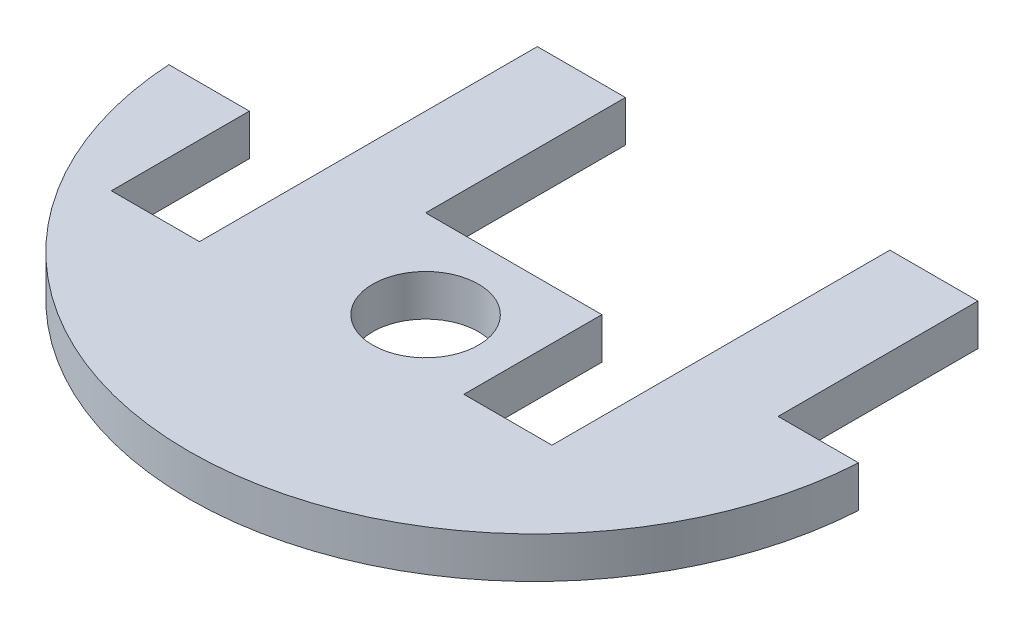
ISO-10303-21;
HEADER;
FILE_DESCRIPTION(('STEP AP214'),'2;1');
FILE_NAME('part.step','',(''),(''),'','','');
FILE_SCHEMA(('AUTOMOTIVE_DESIGN { 1 0 10303 214 1 1 1 1 }'));
ENDSEC;
DATA;
#1=APPLICATION_CONTEXT('core data for automotive mechanical design processes');
#2=APPLICATION_PROTOCOL_DEFINITION('international standard','automotive_design',2000,#1);
#3=PRODUCT_CONTEXT('',#1,'mechanical');
#4=PRODUCT('Part','Part','',(#3));
#5=PRODUCT_RELATED_PRODUCT_CATEGORY('part','',(#4));
#6=PRODUCT_DEFINITION_FORMATION('','',#4);
#7=PRODUCT_DEFINITION_CONTEXT('part definition',#1,'design');
#8=PRODUCT_DEFINITION('design','',#6,#7);
#9=PRODUCT_DEFINITION_SHAPE('','',#8);
#10=(LENGTH_UNIT() NAMED_UNIT(*) SI_UNIT(.MILLI.,.METRE.));
#11=(NAMED_UNIT(*) PLANE_ANGLE_UNIT() SI_UNIT($,.RADIAN.));
#12=(NAMED_UNIT(*) SI_UNIT($,.STERADIAN.) SOLID_ANGLE_UNIT());
#13=UNCERTAINTY_MEASURE_WITH_UNIT(LENGTH_MEASURE(1.E-05),#10,'distance_accuracy_value','');
#14=(GEOMETRIC_REPRESENTATION_CONTEXT(3) GLOBAL_UNCERTAINTY_ASSIGNED_CONTEXT((#13)) GLOBAL_UNIT_ASSIGNED_CONTEXT((#10,
#11,#12)) REPRESENTATION_CONTEXT('',''));
#15=CARTESIAN_POINT('',(0.,0.,0.));
#16=DIRECTION('',(0.,0.,1.));
#17=DIRECTION('',(1.,0.,0.));
#18=AXIS2_PLACEMENT_3D('',#15,#16,#17);
#19=CARTESIAN_POINT('',(-27.1869130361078,0.,1.4859));
#20=DIRECTION('',(0.,0.,1.));
#21=DIRECTION('',(1.,0.,0.));
#22=AXIS2_PLACEMENT_3D('',#19,#20,#21);
#23=PLANE('',#22);
#24=DIRECTION('',(1.,0.,0.));
#25=VECTOR('',#24,1.);
#26=CARTESIAN_POINT('',(-27.1869130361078,2.9718,1.4859));
#27=LINE('',#26,#25);
#28=CARTESIAN_POINT('',(-6.35,2.9718,1.4859));
#29=VERTEX_POINT('',#28);
#30=CARTESIAN_POINT('',(6.35,2.9718,1.4859));
#31=VERTEX_POINT('',#30);
#32=EDGE_CURVE('E156',#29,#31,#27,.T.);
#33=ORIENTED_EDGE('',*,*,#32,.T.);
#34=DIRECTION('',(0.,1.,0.));
#35=VECTOR('',#34,1.);
#36=CARTESIAN_POINT('',(6.35,0.,1.4859));
#37=LINE('',#36,#35);
#38=CARTESIAN_POINT('',(6.35,0.,1.4859));
#39=VERTEX_POINT('',#38);
#40=EDGE_CURVE('E143',#39,#31,#37,.T.);
#41=ORIENTED_EDGE('',*,*,#40,.F.);
#42=DIRECTION('',(1.,0.,0.));
#43=VECTOR('',#42,1.);
#44=CARTESIAN_POINT('',(0.,0.,1.4859));
#45=LINE('',#44,#43);
#46=CARTESIAN_POINT('',(-6.35,0.,1.4859));
#47=VERTEX_POINT('',#46);
#48=EDGE_CURVE('E44',#47,#39,#45,.T.);
#49=ORIENTED_EDGE('',*,*,#48,.F.);
#50=DIRECTION('',(0.,1.,0.));
#51=VECTOR('',#50,1.);
#52=CARTESIAN_POINT('',(-6.35,0.,1.4859));
#53=LINE('',#52,#51);
#54=EDGE_CURVE('E196',#47,#29,#53,.T.);
#55=ORIENTED_EDGE('',*,*,#54,.T.);
#56=EDGE_LOOP('',(#33,#41,#49,#55));
#57=FACE_BOUND('',#56,.T.);
#58=ADVANCED_FACE('F36',(#57),#23,.F.);
#59=CARTESIAN_POINT('',(-24.8476108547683,2.9718,1.4859));
#60=VERTEX_POINT('',#59);
#61=CARTESIAN_POINT('',(-19.05,2.9718,1.4859));
#62=VERTEX_POINT('',#61);
#63=EDGE_CURVE('E176',#60,#62,#27,.T.);
#64=ORIENTED_EDGE('',*,*,#63,.T.);
#65=DIRECTION('',(0.,1.,0.));
#66=VECTOR('',#65,1.);
#67=CARTESIAN_POINT('',(-19.05,0.,1.4859));
#68=LINE('',#67,#66);
#69=CARTESIAN_POINT('',(-19.05,0.,1.4859));
#70=VERTEX_POINT('',#69);
#71=EDGE_CURVE('E223',#70,#62,#68,.T.);
#72=ORIENTED_EDGE('',*,*,#71,.F.);
#73=CARTESIAN_POINT('',(-24.8476108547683,0.,1.4859));
#74=VERTEX_POINT('',#73);
#75=EDGE_CURVE('E11',#74,#70,#45,.T.);
#76=ORIENTED_EDGE('',*,*,#75,.F.);
#77=DIRECTION('',(0.,-1.,0.));
#78=VECTOR('',#77,1.);
#79=CARTESIAN_POINT('',(-24.8476108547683,2.9718,1.4859));
#80=LINE('',#79,#78);
#81=EDGE_CURVE('E169',#60,#74,#80,.T.);
#82=ORIENTED_EDGE('',*,*,#81,.F.);
#83=EDGE_LOOP('',(#64,#72,#76,#82));
#84=FACE_BOUND('',#83,.T.);
#85=ADVANCED_FACE('F281',(#84),#23,.F.);
#86=CARTESIAN_POINT('',(0.,2.9718,0.));
#87=DIRECTION('',(0.,-1.,0.));
#88=DIRECTION('',(0.,0.,-1.));
#89=AXIS2_PLACEMENT_3D('',#86,#87,#88);
#90=CYLINDRICAL_SURFACE('',#89,24.892);
#91=CARTESIAN_POINT('',(0.,2.9718,0.));
#92=DIRECTION('',(0.,1.,0.));
#93=DIRECTION('',(0.,0.,1.));
#94=AXIS2_PLACEMENT_3D('',#91,#92,#93);
#95=CIRCLE('',#94,24.892);
#96=CARTESIAN_POINT('',(24.8476108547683,2.9718,1.4859));
#97=VERTEX_POINT('',#96);
#98=EDGE_CURVE('E159',#60,#97,#95,.T.);
#99=ORIENTED_EDGE('',*,*,#98,.F.);
#100=ORIENTED_EDGE('',*,*,#81,.T.);
#101=CARTESIAN_POINT('',(0.,0.,0.));
#102=DIRECTION('',(0.,1.,0.));
#103=DIRECTION('',(0.,0.,1.));
#104=AXIS2_PLACEMENT_3D('',#101,#102,#103);
#105=CIRCLE('',#104,24.892);
#106=CARTESIAN_POINT('',(24.8476108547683,0.,1.4859));
#107=VERTEX_POINT('',#106);
#108=EDGE_CURVE('E163',#74,#107,#105,.T.);
#109=ORIENTED_EDGE('',*,*,#108,.T.);
#110=DIRECTION('',(0.,-1.,0.));
#111=VECTOR('',#110,1.);
#112=CARTESIAN_POINT('',(24.8476108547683,2.9718,1.4859));
#113=LINE('',#112,#111);
#114=EDGE_CURVE('E173',#107,#97,#113,.F.);
#115=ORIENTED_EDGE('',*,*,#114,.T.);
#116=EDGE_LOOP('',(#99,#100,#109,#115));
#117=FACE_BOUND('',#116,.T.);
#118=ADVANCED_FACE('F38',(#117),#90,.T.);
#119=CARTESIAN_POINT('',(0.,2.9718,0.));
#120=DIRECTION('',(0.,1.,0.));
#121=DIRECTION('',(0.,0.,1.));
#122=AXIS2_PLACEMENT_3D('',#119,#120,#121);
#123=PLANE('',#122);
#124=CARTESIAN_POINT('',(0.,2.9718,7.8359));
#125=DIRECTION('',(0.,1.,0.));
#126=DIRECTION('',(0.,0.,1.));
#127=AXIS2_PLACEMENT_3D('',#124,#125,#126);
#128=CIRCLE('',#127,3.81);
#129=CARTESIAN_POINT('',(0.,2.9718,11.6459));
#130=VERTEX_POINT('',#129);
#131=EDGE_CURVE('E251',#130,#130,#128,.T.);
#132=ORIENTED_EDGE('',*,*,#131,.F.);
#133=EDGE_LOOP('',(#132));
#134=FACE_BOUND('',#133,.T.);
#135=DIRECTION('',(0.,0.,1.));
#136=VECTOR('',#135,1.);
#137=CARTESIAN_POINT('',(12.7,2.9718,1.4859));
#138=LINE('',#137,#136);
#139=CARTESIAN_POINT('',(12.7,2.9718,-12.9159));
#140=VERTEX_POINT('',#139);
#141=CARTESIAN_POINT('',(12.7,2.9718,11.43));
#142=VERTEX_POINT('',#141);
#143=EDGE_CURVE('E194',#140,#142,#138,.T.);
#144=ORIENTED_EDGE('',*,*,#143,.T.);
#145=DIRECTION('',(1.,0.,0.));
#146=VECTOR('',#145,1.);
#147=CARTESIAN_POINT('',(12.7,2.9718,11.43));
#148=LINE('',#147,#146);
#149=CARTESIAN_POINT('',(6.35,2.9718,11.43));
#150=VERTEX_POINT('',#149);
#151=EDGE_CURVE('E149',#150,#142,#148,.T.);
#152=ORIENTED_EDGE('',*,*,#151,.F.);
#153=DIRECTION('',(0.,0.,1.));
#154=VECTOR('',#153,1.);
#155=CARTESIAN_POINT('',(6.35,2.9718,1.4859));
#156=LINE('',#155,#154);
#157=EDGE_CURVE('E231',#31,#150,#156,.T.);
#158=ORIENTED_EDGE('',*,*,#157,.F.);
#159=ORIENTED_EDGE('',*,*,#32,.F.);
#160=DIRECTION('',(0.,0.,-1.));
#161=VECTOR('',#160,1.);
#162=CARTESIAN_POINT('',(-6.35,2.9718,1.4859));
#163=LINE('',#162,#161);
#164=CARTESIAN_POINT('',(-6.35,2.9718,-12.9159));
#165=VERTEX_POINT('',#164);
#166=EDGE_CURVE('E214',#29,#165,#163,.T.);
#167=ORIENTED_EDGE('',*,*,#166,.T.);
#168=DIRECTION('',(-1.,0.,0.));
#169=VECTOR('',#168,1.);
#170=CARTESIAN_POINT('',(-6.35,2.9718,-12.9159));
#171=LINE('',#170,#169);
#172=CARTESIAN_POINT('',(-12.7,2.9718,-12.9159));
#173=VERTEX_POINT('',#172);
#174=EDGE_CURVE('E211',#165,#173,#171,.T.);
#175=ORIENTED_EDGE('',*,*,#174,.T.);
#176=DIRECTION('',(0.,0.,1.));
#177=VECTOR('',#176,1.);
#178=CARTESIAN_POINT('',(-12.7,2.9718,1.4859));
#179=LINE('',#178,#177);
#180=CARTESIAN_POINT('',(-12.7,2.9718,11.43));
#181=VERTEX_POINT('',#180);
#182=EDGE_CURVE('E209',#173,#181,#179,.T.);
#183=ORIENTED_EDGE('',*,*,#182,.T.);
#184=DIRECTION('',(1.,0.,0.));
#185=VECTOR('',#184,1.);
#186=CARTESIAN_POINT('',(-12.7,2.9718,11.43));
#187=LINE('',#186,#185);
#188=CARTESIAN_POINT('',(-19.05,2.9718,11.43));
#189=VERTEX_POINT('',#188);
#190=EDGE_CURVE('E232',#189,#181,#187,.T.);
#191=ORIENTED_EDGE('',*,*,#190,.F.);
#192=DIRECTION('',(0.,0.,1.));
#193=VECTOR('',#192,1.);
#194=CARTESIAN_POINT('',(-19.05,2.9718,1.4859));
#195=LINE('',#194,#193);
#196=EDGE_CURVE('E236',#62,#189,#195,.T.);
#197=ORIENTED_EDGE('',*,*,#196,.F.);
#198=ORIENTED_EDGE('',*,*,#63,.F.);
#199=ORIENTED_EDGE('',*,*,#98,.T.);
#200=CARTESIAN_POINT('',(19.05,2.9718,1.4859));
#201=VERTEX_POINT('',#200);
#202=EDGE_CURVE('E179',#201,#97,#27,.T.);
#203=ORIENTED_EDGE('',*,*,#202,.F.);
#204=DIRECTION('',(0.,0.,-1.));
#205=VECTOR('',#204,1.);
#206=CARTESIAN_POINT('',(19.05,2.9718,1.4859));
#207=LINE('',#206,#205);
#208=CARTESIAN_POINT('',(19.05,2.9718,-12.9159));
#209=VERTEX_POINT('',#208);
#210=EDGE_CURVE('E191',#201,#209,#207,.T.);
#211=ORIENTED_EDGE('',*,*,#210,.T.);
#212=DIRECTION('',(-1.,0.,0.));
#213=VECTOR('',#212,1.);
#214=CARTESIAN_POINT('',(12.7,2.9718,-12.9159));
#215=LINE('',#214,#213);
#216=EDGE_CURVE('E187',#209,#140,#215,.T.);
#217=ORIENTED_EDGE('',*,*,#216,.T.);
#218=EDGE_LOOP('',(#144,#152,#158,#159,#167,#175,#183,#191,#197,#198,#199,#203,#211,#217));
#219=FACE_BOUND('',#218,.T.);
#220=ADVANCED_FACE('F264',(#134,#219),#123,.T.);
#221=CARTESIAN_POINT('',(0.,0.,0.));
#222=DIRECTION('',(0.,1.,0.));
#223=DIRECTION('',(0.,0.,1.));
#224=AXIS2_PLACEMENT_3D('',#221,#222,#223);
#225=PLANE('',#224);
#226=CARTESIAN_POINT('',(0.,0.,7.8359));
#227=DIRECTION('',(0.,1.,0.));
#228=DIRECTION('',(0.,0.,1.));
#229=AXIS2_PLACEMENT_3D('',#226,#227,#228);
#230=CIRCLE('',#229,3.81);
#231=CARTESIAN_POINT('',(0.,0.,11.6459));
#232=VERTEX_POINT('',#231);
#233=EDGE_CURVE('E239',#232,#232,#230,.T.);
#234=ORIENTED_EDGE('',*,*,#233,.T.);
#235=EDGE_LOOP('',(#234));
#236=FACE_BOUND('',#235,.T.);
#237=DIRECTION('',(1.,0.,0.));
#238=VECTOR('',#237,1.);
#239=CARTESIAN_POINT('',(12.7,0.,11.43));
#240=LINE('',#239,#238);
#241=CARTESIAN_POINT('',(6.35,0.,11.43));
#242=VERTEX_POINT('',#241);
#243=CARTESIAN_POINT('',(12.7,0.,11.43));
#244=VERTEX_POINT('',#243);
#245=EDGE_CURVE('E148',#242,#244,#240,.T.);
#246=ORIENTED_EDGE('',*,*,#245,.T.);
#247=DIRECTION('',(0.,0.,1.));
#248=VECTOR('',#247,1.);
#249=CARTESIAN_POINT('',(12.7,0.,1.4859));
#250=LINE('',#249,#248);
#251=CARTESIAN_POINT('',(12.7,0.,-12.9159));
#252=VERTEX_POINT('',#251);
#253=EDGE_CURVE('E190',#252,#244,#250,.T.);
#254=ORIENTED_EDGE('',*,*,#253,.F.);
#255=DIRECTION('',(-1.,0.,0.));
#256=VECTOR('',#255,1.);
#257=CARTESIAN_POINT('',(12.7,0.,-12.9159));
#258=LINE('',#257,#256);
#259=CARTESIAN_POINT('',(19.05,0.,-12.9159));
#260=VERTEX_POINT('',#259);
#261=EDGE_CURVE('E183',#260,#252,#258,.T.);
#262=ORIENTED_EDGE('',*,*,#261,.F.);
#263=DIRECTION('',(0.,0.,-1.));
#264=VECTOR('',#263,1.);
#265=CARTESIAN_POINT('',(19.05,0.,1.4859));
#266=LINE('',#265,#264);
#267=CARTESIAN_POINT('',(19.05,0.,1.4859));
#268=VERTEX_POINT('',#267);
#269=EDGE_CURVE('E199',#268,#260,#266,.T.);
#270=ORIENTED_EDGE('',*,*,#269,.F.);
#271=EDGE_CURVE('E45',#268,#107,#45,.T.);
#272=ORIENTED_EDGE('',*,*,#271,.T.);
#273=ORIENTED_EDGE('',*,*,#108,.F.);
#274=ORIENTED_EDGE('',*,*,#75,.T.);
#275=DIRECTION('',(0.,0.,1.));
#276=VECTOR('',#275,1.);
#277=CARTESIAN_POINT('',(-19.05,0.,1.4859));
#278=LINE('',#277,#276);
#279=CARTESIAN_POINT('',(-19.05,0.,11.43));
#280=VERTEX_POINT('',#279);
#281=EDGE_CURVE('E235',#70,#280,#278,.T.);
#282=ORIENTED_EDGE('',*,*,#281,.T.);
#283=DIRECTION('',(1.,0.,0.));
#284=VECTOR('',#283,1.);
#285=CARTESIAN_POINT('',(-12.7,0.,11.43));
#286=LINE('',#285,#284);
#287=CARTESIAN_POINT('',(-12.7,0.,11.43));
#288=VERTEX_POINT('',#287);
#289=EDGE_CURVE('E226',#280,#288,#286,.T.);
#290=ORIENTED_EDGE('',*,*,#289,.T.);
#291=DIRECTION('',(0.,0.,1.));
#292=VECTOR('',#291,1.);
#293=CARTESIAN_POINT('',(-12.7,0.,1.4859));
#294=LINE('',#293,#292);
#295=CARTESIAN_POINT('',(-12.7,0.,-12.9159));
#296=VERTEX_POINT('',#295);
#297=EDGE_CURVE('E206',#296,#288,#294,.T.);
#298=ORIENTED_EDGE('',*,*,#297,.F.);
#299=DIRECTION('',(-1.,0.,0.));
#300=VECTOR('',#299,1.);
#301=CARTESIAN_POINT('',(-6.35,0.,-12.9159));
#302=LINE('',#301,#300);
#303=CARTESIAN_POINT('',(-6.35,0.,-12.9159));
#304=VERTEX_POINT('',#303);
#305=EDGE_CURVE('E219',#304,#296,#302,.T.);
#306=ORIENTED_EDGE('',*,*,#305,.F.);
#307=DIRECTION('',(0.,0.,-1.));
#308=VECTOR('',#307,1.);
#309=CARTESIAN_POINT('',(-6.35,0.,1.4859));
#310=LINE('',#309,#308);
#311=EDGE_CURVE('E52',#47,#304,#310,.T.);
#312=ORIENTED_EDGE('',*,*,#311,.F.);
#313=ORIENTED_EDGE('',*,*,#48,.T.);
#314=DIRECTION('',(0.,0.,1.));
#315=VECTOR('',#314,1.);
#316=CARTESIAN_POINT('',(6.35,0.,1.4859));
#317=LINE('',#316,#315);
#318=EDGE_CURVE('E139',#39,#242,#317,.T.);
#319=ORIENTED_EDGE('',*,*,#318,.T.);
#320=EDGE_LOOP('',(#246,#254,#262,#270,#272,#273,#274,#282,#290,#298,#306,#312,#313,#319));
#321=FACE_BOUND('',#320,.T.);
#322=ADVANCED_FACE('F158',(#236,#321),#225,.F.);
#323=ORIENTED_EDGE('',*,*,#271,.F.);
#324=DIRECTION('',(0.,1.,0.));
#325=VECTOR('',#324,1.);
#326=CARTESIAN_POINT('',(19.05,0.,1.4859));
#327=LINE('',#326,#325);
#328=EDGE_CURVE('E180',#268,#201,#327,.T.);
#329=ORIENTED_EDGE('',*,*,#328,.T.);
#330=ORIENTED_EDGE('',*,*,#202,.T.);
#331=ORIENTED_EDGE('',*,*,#114,.F.);
#332=EDGE_LOOP('',(#323,#329,#330,#331));
#333=FACE_BOUND('',#332,.T.);
#334=ADVANCED_FACE('F276',(#333),#23,.F.);
#335=CARTESIAN_POINT('',(12.7,0.,1.4859));
#336=DIRECTION('',(-1.,0.,0.));
#337=DIRECTION('',(0.,0.,1.));
#338=AXIS2_PLACEMENT_3D('',#335,#336,#337);
#339=PLANE('',#338);
#340=ORIENTED_EDGE('',*,*,#143,.F.);
#341=DIRECTION('',(0.,1.,0.));
#342=VECTOR('',#341,1.);
#343=CARTESIAN_POINT('',(12.7,0.,-12.9159));
#344=LINE('',#343,#342);
#345=EDGE_CURVE('E185',#252,#140,#344,.T.);
#346=ORIENTED_EDGE('',*,*,#345,.F.);
#347=ORIENTED_EDGE('',*,*,#253,.T.);
#348=DIRECTION('',(0.,1.,0.));
#349=VECTOR('',#348,1.);
#350=CARTESIAN_POINT('',(12.7,0.,11.43));
#351=LINE('',#350,#349);
#352=EDGE_CURVE('E217',#244,#142,#351,.T.);
#353=ORIENTED_EDGE('',*,*,#352,.T.);
#354=EDGE_LOOP('',(#340,#346,#347,#353));
#355=FACE_BOUND('',#354,.T.);
#356=ADVANCED_FACE('F272',(#355),#339,.T.);
#357=CARTESIAN_POINT('',(12.7,0.,-12.9159));
#358=DIRECTION('',(0.,0.,-1.));
#359=DIRECTION('',(-1.,0.,0.));
#360=AXIS2_PLACEMENT_3D('',#357,#358,#359);
#361=PLANE('',#360);
#362=ORIENTED_EDGE('',*,*,#216,.F.);
#363=DIRECTION('',(0.,1.,0.));
#364=VECTOR('',#363,1.);
#365=CARTESIAN_POINT('',(19.05,0.,-12.9159));
#366=LINE('',#365,#364);
#367=EDGE_CURVE('E182',#260,#209,#366,.T.);
#368=ORIENTED_EDGE('',*,*,#367,.F.);
#369=ORIENTED_EDGE('',*,*,#261,.T.);
#370=ORIENTED_EDGE('',*,*,#345,.T.);
#371=EDGE_LOOP('',(#362,#368,#369,#370));
#372=FACE_BOUND('',#371,.T.);
#373=ADVANCED_FACE('F307',(#372),#361,.T.);
#374=CARTESIAN_POINT('',(19.05,0.,1.4859));
#375=DIRECTION('',(1.,0.,0.));
#376=DIRECTION('',(0.,0.,-1.));
#377=AXIS2_PLACEMENT_3D('',#374,#375,#376);
#378=PLANE('',#377);
#379=ORIENTED_EDGE('',*,*,#210,.F.);
#380=ORIENTED_EDGE('',*,*,#328,.F.);
#381=ORIENTED_EDGE('',*,*,#269,.T.);
#382=ORIENTED_EDGE('',*,*,#367,.T.);
#383=EDGE_LOOP('',(#379,#380,#381,#382));
#384=FACE_BOUND('',#383,.T.);
#385=ADVANCED_FACE('F300',(#384),#378,.T.);
#386=CARTESIAN_POINT('',(-6.35,0.,1.4859));
#387=DIRECTION('',(1.,0.,0.));
#388=DIRECTION('',(0.,0.,-1.));
#389=AXIS2_PLACEMENT_3D('',#386,#387,#388);
#390=PLANE('',#389);
#391=ORIENTED_EDGE('',*,*,#166,.F.);
#392=ORIENTED_EDGE('',*,*,#54,.F.);
#393=ORIENTED_EDGE('',*,*,#311,.T.);
#394=DIRECTION('',(0.,1.,0.));
#395=VECTOR('',#394,1.);
#396=CARTESIAN_POINT('',(-6.35,0.,-12.9159));
#397=LINE('',#396,#395);
#398=EDGE_CURVE('E203',#304,#165,#397,.T.);
#399=ORIENTED_EDGE('',*,*,#398,.T.);
#400=EDGE_LOOP('',(#391,#392,#393,#399));
#401=FACE_BOUND('',#400,.T.);
#402=ADVANCED_FACE('F297',(#401),#390,.T.);
#403=CARTESIAN_POINT('',(-12.7,0.,1.4859));
#404=DIRECTION('',(-1.,0.,0.));
#405=DIRECTION('',(0.,0.,1.));
#406=AXIS2_PLACEMENT_3D('',#403,#404,#405);
#407=PLANE('',#406);
#408=ORIENTED_EDGE('',*,*,#182,.F.);
#409=DIRECTION('',(0.,1.,0.));
#410=VECTOR('',#409,1.);
#411=CARTESIAN_POINT('',(-12.7,0.,-12.9159));
#412=LINE('',#411,#410);
#413=EDGE_CURVE('E205',#296,#173,#412,.T.);
#414=ORIENTED_EDGE('',*,*,#413,.F.);
#415=ORIENTED_EDGE('',*,*,#297,.T.);
#416=DIRECTION('',(0.,1.,0.));
#417=VECTOR('',#416,1.);
#418=CARTESIAN_POINT('',(-12.7,0.,11.43));
#419=LINE('',#418,#417);
#420=EDGE_CURVE('E228',#288,#181,#419,.T.);
#421=ORIENTED_EDGE('',*,*,#420,.T.);
#422=EDGE_LOOP('',(#408,#414,#415,#421));
#423=FACE_BOUND('',#422,.T.);
#424=ADVANCED_FACE('F299',(#423),#407,.T.);
#425=CARTESIAN_POINT('',(-6.35,0.,-12.9159));
#426=DIRECTION('',(0.,0.,-1.));
#427=DIRECTION('',(-1.,0.,0.));
#428=AXIS2_PLACEMENT_3D('',#425,#426,#427);
#429=PLANE('',#428);
#430=ORIENTED_EDGE('',*,*,#174,.F.);
#431=ORIENTED_EDGE('',*,*,#398,.F.);
#432=ORIENTED_EDGE('',*,*,#305,.T.);
#433=ORIENTED_EDGE('',*,*,#413,.T.);
#434=EDGE_LOOP('',(#430,#431,#432,#433));
#435=FACE_BOUND('',#434,.T.);
#436=ADVANCED_FACE('F295',(#435),#429,.T.);
#437=CARTESIAN_POINT('',(-12.7,0.,11.43));
#438=DIRECTION('',(0.,0.,1.));
#439=DIRECTION('',(1.,0.,0.));
#440=AXIS2_PLACEMENT_3D('',#437,#438,#439);
#441=PLANE('',#440);
#442=ORIENTED_EDGE('',*,*,#190,.T.);
#443=ORIENTED_EDGE('',*,*,#420,.F.);
#444=ORIENTED_EDGE('',*,*,#289,.F.);
#445=DIRECTION('',(0.,1.,0.));
#446=VECTOR('',#445,1.);
#447=CARTESIAN_POINT('',(-19.05,0.,11.43));
#448=LINE('',#447,#446);
#449=EDGE_CURVE('E225',#280,#189,#448,.T.);
#450=ORIENTED_EDGE('',*,*,#449,.T.);
#451=EDGE_LOOP('',(#442,#443,#444,#450));
#452=FACE_BOUND('',#451,.T.);
#453=ADVANCED_FACE('F289',(#452),#441,.F.);
#454=CARTESIAN_POINT('',(-19.05,0.,1.4859));
#455=DIRECTION('',(-1.,0.,0.));
#456=DIRECTION('',(0.,0.,1.));
#457=AXIS2_PLACEMENT_3D('',#454,#455,#456);
#458=PLANE('',#457);
#459=ORIENTED_EDGE('',*,*,#196,.T.);
#460=ORIENTED_EDGE('',*,*,#449,.F.);
#461=ORIENTED_EDGE('',*,*,#281,.F.);
#462=ORIENTED_EDGE('',*,*,#71,.T.);
#463=EDGE_LOOP('',(#459,#460,#461,#462));
#464=FACE_BOUND('',#463,.T.);
#465=ADVANCED_FACE('F284',(#464),#458,.F.);
#466=CARTESIAN_POINT('',(12.7,0.,11.43));
#467=DIRECTION('',(0.,0.,1.));
#468=DIRECTION('',(1.,0.,0.));
#469=AXIS2_PLACEMENT_3D('',#466,#467,#468);
#470=PLANE('',#469);
#471=ORIENTED_EDGE('',*,*,#151,.T.);
#472=ORIENTED_EDGE('',*,*,#352,.F.);
#473=ORIENTED_EDGE('',*,*,#245,.F.);
#474=DIRECTION('',(0.,1.,0.));
#475=VECTOR('',#474,1.);
#476=CARTESIAN_POINT('',(6.35,0.,11.43));
#477=LINE('',#476,#475);
#478=EDGE_CURVE('E145',#242,#150,#477,.T.);
#479=ORIENTED_EDGE('',*,*,#478,.T.);
#480=EDGE_LOOP('',(#471,#472,#473,#479));
#481=FACE_BOUND('',#480,.T.);
#482=ADVANCED_FACE('F275',(#481),#470,.F.);
#483=CARTESIAN_POINT('',(6.35,0.,1.4859));
#484=DIRECTION('',(-1.,0.,0.));
#485=DIRECTION('',(0.,0.,1.));
#486=AXIS2_PLACEMENT_3D('',#483,#484,#485);
#487=PLANE('',#486);
#488=ORIENTED_EDGE('',*,*,#157,.T.);
#489=ORIENTED_EDGE('',*,*,#478,.F.);
#490=ORIENTED_EDGE('',*,*,#318,.F.);
#491=ORIENTED_EDGE('',*,*,#40,.T.);
#492=EDGE_LOOP('',(#488,#489,#490,#491));
#493=FACE_BOUND('',#492,.T.);
#494=ADVANCED_FACE('F142',(#493),#487,.F.);
#495=CARTESIAN_POINT('',(0.,0.,7.8359));
#496=DIRECTION('',(0.,1.,0.));
#497=DIRECTION('',(0.,0.,1.));
#498=AXIS2_PLACEMENT_3D('',#495,#496,#497);
#499=CYLINDRICAL_SURFACE('',#498,3.81);
#500=ORIENTED_EDGE('',*,*,#233,.F.);
#501=EDGE_LOOP('',(#500));
#502=FACE_BOUND('',#501,.T.);
#503=ORIENTED_EDGE('',*,*,#131,.T.);
#504=EDGE_LOOP('',(#503));
#505=FACE_BOUND('',#504,.T.);
#506=ADVANCED_FACE('F258',(#502,#505),#499,.F.);
#507=CLOSED_SHELL('',(#58,#85,#118,#220,#322,#334,#356,#373,#385,#402,#424,#436,#453,#465,#482,
#494,#506));
#508=MANIFOLD_SOLID_BREP('B2',#507);
#509=ADVANCED_BREP_SHAPE_REPRESENTATION('',(#18,#508),#14);
#510=SHAPE_DEFINITION_REPRESENTATION(#9,#509);
ENDSEC;
END-ISO-10303-21;
